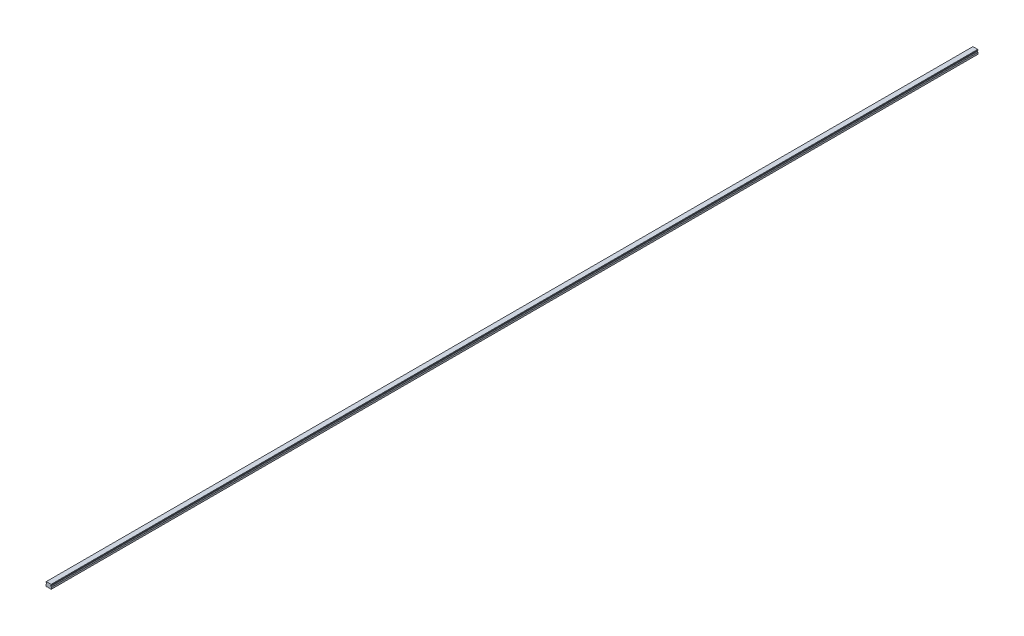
from build123d import *

# Parameters (mm, degrees)
SKETCH1_W           = 20
SKETCH1_H           = 16.3
BOSS_EXTRUDE1_DEPTH = 1730
CUT_EXTRUDE1_DEPTH  = 3461.052844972
CHAMFER1_SIZE       = 1
FILLET1_R           = 1
CUT_EXTRUDE2_DEPTH  = 3461.052844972
SKETCH5_R           = 3
SKETCH5_R_2         = 2.5
CUT_EXTRUDE5_DEPTH  = 10
SKETCH5_2_R         = 2.5
CUT_EXTRUDE6_DEPTH  = 13
LPATTERN2_COUNT     = 58
LPATTERN2_PITCH     = 60


with BuildPart() as part:
    # Sketch1 → Boss-Extrude1 (new, symmetric)
    with BuildSketch(Plane.XY):
        with Locations((0, 8.15)):
            Rectangle(SKETCH1_W, SKETCH1_H)
    extrude(amount=BOSS_EXTRUDE1_DEPTH, both=True)

    # Sketch2 → Cut-Extrude1 (cut, through all)
    with BuildSketch(Plane.XY.offset(1730)):
        Polygon((-10, 14.3), (-10, 7.3), (-7.666666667, 9.633333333), (-7.666666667, 11.966666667), align=None)
        Polygon((7.666666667, 11.966666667), (10, 14.3), (10, 7.3), (7.666666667, 9.633333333), align=None)
    extrude(amount=-CUT_EXTRUDE1_DEPTH, mode=Mode.SUBTRACT)

    # Chamfer1
    chamfer1_edges = [part.edges().sort_by_distance(p)[0] for p in [
        (-10, 16.3, 0),
        (10, 16.3, 0),
        (10, 0, 0),
        (-10, 0, 0),
    ]]
    chamfer(chamfer1_edges, length=CHAMFER1_SIZE)

    # Fillet1
    fillet1_edges = [part.edges().sort_by_distance(p)[0] for p in [
        (-7.666666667, 11.966666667, 0),
        (-7.666666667, 9.633333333, 0),
        (7.666666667, 9.633333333, 0),
        (7.666666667, 11.966666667, 0),
    ]]
    fillet(fillet1_edges, radius=FILLET1_R)

    # Sketch3 → Cut-Extrude2 (cut, through all)
    with BuildSketch(Plane.XY.offset(1730)):
        Polygon((-6, 0), (-5, 1), (5, 1), (6, 0), align=None)
    extrude(amount=-CUT_EXTRUDE2_DEPTH, mode=Mode.SUBTRACT)

    # Sketch5 → Cut-Extrude5 (cut)
    with BuildSketch(Plane.XZ.offset(-1)):
        with Locations(Location((0, 1710, 0), (0, 0, 270))):
            Circle(SKETCH5_R)
        with Locations(Location((0, 1710, 0), (0, 0, 270))):
            Circle(SKETCH5_R_2, mode=Mode.SUBTRACT)
    cut_extrude5 = extrude(amount=-CUT_EXTRUDE5_DEPTH, mode=Mode.SUBTRACT)

    # Sketch5_2 → Cut-Extrude6 (cut)
    with BuildSketch(Plane.XZ.offset(-1)):
        with Locations(Location((0, 1710, 0), (0, 0, 270))):
            Circle(SKETCH5_2_R)
    cut_extrude6 = extrude(amount=-CUT_EXTRUDE6_DEPTH, mode=Mode.SUBTRACT)

    # Cut-Extrude7 cone 1 section (on through the dimple's axis) → Cut-Extrude7 (revolve, cut)
    with BuildSketch(Plane(origin=(0, 14, 1710), x_dir=(0, 0, -1), z_dir=(1, 0, 0))):
        Polygon((0, 0), (2.5, 0), (0, 1.443375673), align=None)
    cut_extrude7 = revolve(axis=Axis((0, 14, 1710), (0, 1, 0)), mode=Mode.SUBTRACT)

    # LPattern2: Cut-Extrude5, Cut-Extrude6, Cut-Extrude7 ×58
    with Locations(*[(0, 0, -i * LPATTERN2_PITCH) for i in range(1, LPATTERN2_COUNT)]):
        add(cut_extrude5, mode=Mode.SUBTRACT)
        add(cut_extrude6, mode=Mode.SUBTRACT)
        add(cut_extrude7, mode=Mode.SUBTRACT)


solid = part.part
